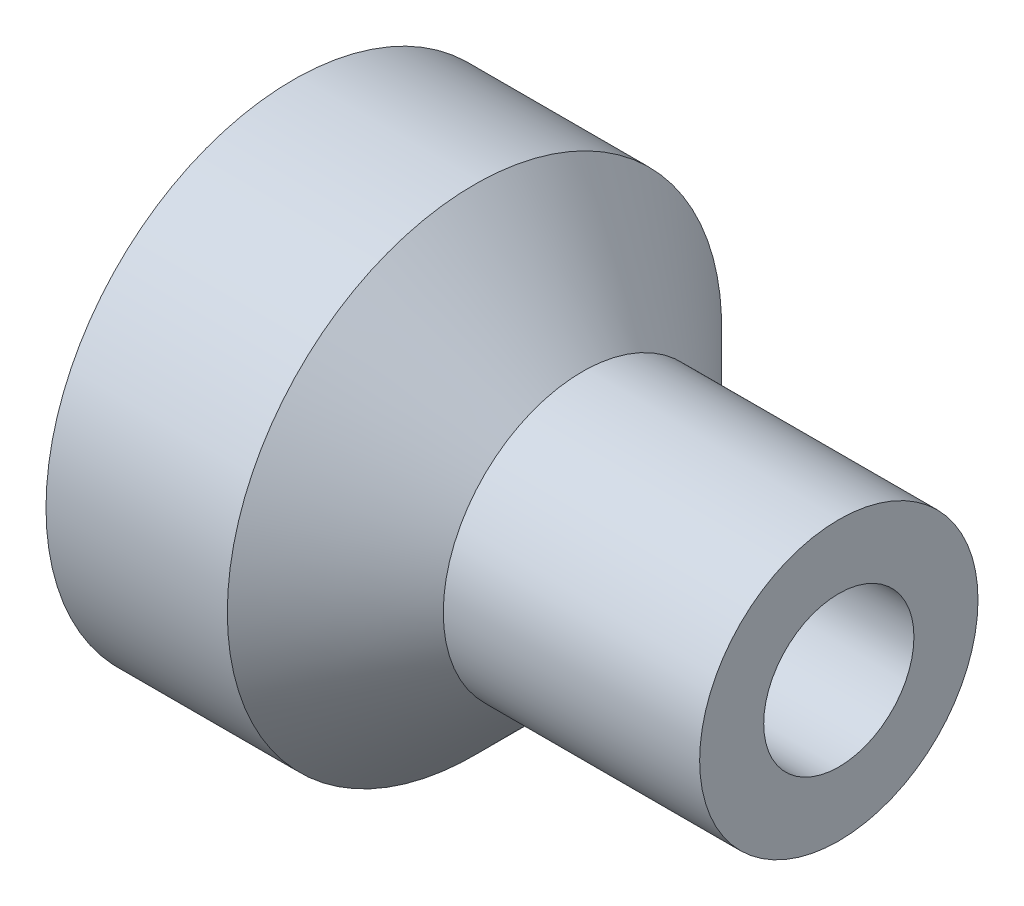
ISO-10303-21;
HEADER;
FILE_DESCRIPTION(('STEP AP214'),'2;1');
FILE_NAME('part.step','',(''),(''),'','','');
FILE_SCHEMA(('AUTOMOTIVE_DESIGN { 1 0 10303 214 1 1 1 1 }'));
ENDSEC;
DATA;
#1=APPLICATION_CONTEXT('core data for automotive mechanical design processes');
#2=APPLICATION_PROTOCOL_DEFINITION('international standard','automotive_design',2000,#1);
#3=PRODUCT_CONTEXT('',#1,'mechanical');
#4=PRODUCT('Part','Part','',(#3));
#5=PRODUCT_RELATED_PRODUCT_CATEGORY('part','',(#4));
#6=PRODUCT_DEFINITION_FORMATION('','',#4);
#7=PRODUCT_DEFINITION_CONTEXT('part definition',#1,'design');
#8=PRODUCT_DEFINITION('design','',#6,#7);
#9=PRODUCT_DEFINITION_SHAPE('','',#8);
#10=(LENGTH_UNIT() NAMED_UNIT(*) SI_UNIT(.MILLI.,.METRE.));
#11=(NAMED_UNIT(*) PLANE_ANGLE_UNIT() SI_UNIT($,.RADIAN.));
#12=(NAMED_UNIT(*) SI_UNIT($,.STERADIAN.) SOLID_ANGLE_UNIT());
#13=UNCERTAINTY_MEASURE_WITH_UNIT(LENGTH_MEASURE(1.E-05),#10,'distance_accuracy_value','');
#14=(GEOMETRIC_REPRESENTATION_CONTEXT(3) GLOBAL_UNCERTAINTY_ASSIGNED_CONTEXT((#13)) GLOBAL_UNIT_ASSIGNED_CONTEXT((#10,
#11,#12)) REPRESENTATION_CONTEXT('',''));
#15=CARTESIAN_POINT('',(0.,0.,0.));
#16=DIRECTION('',(0.,0.,1.));
#17=DIRECTION('',(1.,0.,0.));
#18=AXIS2_PLACEMENT_3D('',#15,#16,#17);
#19=CARTESIAN_POINT('',(15.8,0.,0.));
#20=DIRECTION('',(-1.,0.,0.));
#21=DIRECTION('',(0.,0.,1.));
#22=AXIS2_PLACEMENT_3D('',#19,#20,#21);
#23=CYLINDRICAL_SURFACE('',#22,2.175);
#24=CARTESIAN_POINT('',(9.00000000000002,0.,0.));
#25=DIRECTION('',(-1.,0.,0.));
#26=DIRECTION('',(0.,0.,1.));
#27=AXIS2_PLACEMENT_3D('',#24,#25,#26);
#28=CIRCLE('',#27,2.175);
#29=CARTESIAN_POINT('',(9.00000000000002,0.,2.175));
#30=VERTEX_POINT('',#29);
#31=EDGE_CURVE('E40',#30,#30,#28,.T.);
#32=ORIENTED_EDGE('',*,*,#31,.T.);
#33=EDGE_LOOP('',(#32));
#34=FACE_BOUND('',#33,.T.);
#35=CARTESIAN_POINT('',(15.8,0.,0.));
#36=DIRECTION('',(1.,0.,0.));
#37=DIRECTION('',(0.,0.,-1.));
#38=AXIS2_PLACEMENT_3D('',#35,#36,#37);
#39=CIRCLE('',#38,2.175);
#40=CARTESIAN_POINT('',(15.8,0.,-2.175));
#41=VERTEX_POINT('',#40);
#42=EDGE_CURVE('E56',#41,#41,#39,.T.);
#43=ORIENTED_EDGE('',*,*,#42,.T.);
#44=EDGE_LOOP('',(#43));
#45=FACE_BOUND('',#44,.T.);
#46=ADVANCED_FACE('F33',(#34,#45),#23,.F.);
#47=CARTESIAN_POINT('',(15.8,0.,0.));
#48=DIRECTION('',(-1.,0.,0.));
#49=DIRECTION('',(0.,0.,1.));
#50=AXIS2_PLACEMENT_3D('',#47,#48,#49);
#51=CYLINDRICAL_SURFACE('',#50,4.03);
#52=CARTESIAN_POINT('',(8.37669643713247,0.,0.));
#53=DIRECTION('',(-1.,0.,0.));
#54=DIRECTION('',(0.,0.,1.));
#55=AXIS2_PLACEMENT_3D('',#52,#53,#54);
#56=CIRCLE('',#55,4.03);
#57=CARTESIAN_POINT('',(8.37669643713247,0.,4.03));
#58=VERTEX_POINT('',#57);
#59=EDGE_CURVE('E44',#58,#58,#56,.F.);
#60=ORIENTED_EDGE('',*,*,#59,.T.);
#61=EDGE_LOOP('',(#60));
#62=FACE_BOUND('',#61,.T.);
#63=CARTESIAN_POINT('',(15.8,0.,0.));
#64=DIRECTION('',(1.,0.,0.));
#65=DIRECTION('',(0.,0.,-1.));
#66=AXIS2_PLACEMENT_3D('',#63,#64,#65);
#67=CIRCLE('',#66,4.03);
#68=CARTESIAN_POINT('',(15.8,0.,-4.03));
#69=VERTEX_POINT('',#68);
#70=EDGE_CURVE('E53',#69,#69,#67,.T.);
#71=ORIENTED_EDGE('',*,*,#70,.F.);
#72=EDGE_LOOP('',(#71));
#73=FACE_BOUND('',#72,.T.);
#74=ADVANCED_FACE('F87',(#62,#73),#51,.T.);
#75=CARTESIAN_POINT('',(15.8,0.,0.));
#76=DIRECTION('',(1.,0.,0.));
#77=DIRECTION('',(0.,0.,-1.));
#78=AXIS2_PLACEMENT_3D('',#75,#76,#77);
#79=PLANE('',#78);
#80=ORIENTED_EDGE('',*,*,#70,.T.);
#81=EDGE_LOOP('',(#80));
#82=FACE_BOUND('',#81,.T.);
#83=ORIENTED_EDGE('',*,*,#42,.F.);
#84=EDGE_LOOP('',(#83));
#85=FACE_BOUND('',#84,.T.);
#86=ADVANCED_FACE('F72',(#82,#85),#79,.T.);
#87=CARTESIAN_POINT('',(0.,0.,0.));
#88=DIRECTION('',(1.,0.,0.));
#89=DIRECTION('',(0.,0.,-1.));
#90=AXIS2_PLACEMENT_3D('',#87,#88,#89);
#91=PLANE('',#90);
#92=CARTESIAN_POINT('',(0.,0.,0.));
#93=DIRECTION('',(-1.,0.,0.));
#94=DIRECTION('',(0.,0.,1.));
#95=AXIS2_PLACEMENT_3D('',#92,#93,#94);
#96=CIRCLE('',#95,3.075);
#97=CARTESIAN_POINT('',(0.,0.,3.075));
#98=VERTEX_POINT('',#97);
#99=EDGE_CURVE('E62',#98,#98,#96,.T.);
#100=ORIENTED_EDGE('',*,*,#99,.F.);
#101=EDGE_LOOP('',(#100));
#102=FACE_BOUND('',#101,.T.);
#103=CARTESIAN_POINT('',(0.,0.,0.));
#104=DIRECTION('',(-1.,0.,0.));
#105=DIRECTION('',(0.,0.,1.));
#106=AXIS2_PLACEMENT_3D('',#103,#104,#105);
#107=CIRCLE('',#106,7.1566964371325);
#108=CARTESIAN_POINT('',(0.,0.,7.1566964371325));
#109=VERTEX_POINT('',#108);
#110=EDGE_CURVE('E59',#109,#109,#107,.T.);
#111=ORIENTED_EDGE('',*,*,#110,.T.);
#112=EDGE_LOOP('',(#111));
#113=FACE_BOUND('',#112,.T.);
#114=ADVANCED_FACE('F68',(#102,#113),#91,.F.);
#115=CARTESIAN_POINT('',(8.8,0.,0.));
#116=DIRECTION('',(-1.,0.,0.));
#117=DIRECTION('',(0.,0.,1.));
#118=AXIS2_PLACEMENT_3D('',#115,#116,#117);
#119=CYLINDRICAL_SURFACE('',#118,7.1566964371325);
#120=CARTESIAN_POINT('',(5.24999999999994,0.,0.));
#121=DIRECTION('',(-1.,0.,0.));
#122=DIRECTION('',(0.,0.,1.));
#123=AXIS2_PLACEMENT_3D('',#120,#121,#122);
#124=CIRCLE('',#123,7.1566964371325);
#125=CARTESIAN_POINT('',(5.24999999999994,0.,7.1566964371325));
#126=VERTEX_POINT('',#125);
#127=EDGE_CURVE('E48',#126,#126,#124,.T.);
#128=ORIENTED_EDGE('',*,*,#127,.T.);
#129=EDGE_LOOP('',(#128));
#130=FACE_BOUND('',#129,.T.);
#131=ORIENTED_EDGE('',*,*,#110,.F.);
#132=EDGE_LOOP('',(#131));
#133=FACE_BOUND('',#132,.T.);
#134=ADVANCED_FACE('F71',(#130,#133),#119,.T.);
#135=CARTESIAN_POINT('',(5.24999999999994,0.,0.));
#136=DIRECTION('',(-1.,0.,0.));
#137=DIRECTION('',(0.,0.,1.));
#138=AXIS2_PLACEMENT_3D('',#135,#136,#137);
#139=CONICAL_SURFACE('',#138,7.1566964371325,0.785398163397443);
#140=ORIENTED_EDGE('',*,*,#59,.F.);
#141=EDGE_LOOP('',(#140));
#142=FACE_BOUND('',#141,.T.);
#143=ORIENTED_EDGE('',*,*,#127,.F.);
#144=EDGE_LOOP('',(#143));
#145=FACE_BOUND('',#144,.T.);
#146=ADVANCED_FACE('F77',(#142,#145),#139,.T.);
#147=CARTESIAN_POINT('',(8.,0.,0.));
#148=DIRECTION('',(-1.,0.,0.));
#149=DIRECTION('',(0.,0.,1.));
#150=AXIS2_PLACEMENT_3D('',#147,#148,#149);
#151=CYLINDRICAL_SURFACE('',#150,3.075);
#152=CARTESIAN_POINT('',(8.10000000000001,0.,0.));
#153=DIRECTION('',(-1.,0.,0.));
#154=DIRECTION('',(0.,0.,1.));
#155=AXIS2_PLACEMENT_3D('',#152,#153,#154);
#156=CIRCLE('',#155,3.075);
#157=CARTESIAN_POINT('',(8.10000000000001,0.,3.075));
#158=VERTEX_POINT('',#157);
#159=EDGE_CURVE('E10',#158,#158,#156,.F.);
#160=ORIENTED_EDGE('',*,*,#159,.T.);
#161=EDGE_LOOP('',(#160));
#162=FACE_BOUND('',#161,.T.);
#163=ORIENTED_EDGE('',*,*,#99,.T.);
#164=EDGE_LOOP('',(#163));
#165=FACE_BOUND('',#164,.T.);
#166=ADVANCED_FACE('F66',(#162,#165),#151,.F.);
#167=CARTESIAN_POINT('',(9.00000000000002,0.,0.));
#168=DIRECTION('',(-1.,0.,0.));
#169=DIRECTION('',(0.,0.,1.));
#170=AXIS2_PLACEMENT_3D('',#167,#168,#169);
#171=CONICAL_SURFACE('',#170,2.175,0.785398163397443);
#172=ORIENTED_EDGE('',*,*,#159,.F.);
#173=EDGE_LOOP('',(#172));
#174=FACE_BOUND('',#173,.T.);
#175=ORIENTED_EDGE('',*,*,#31,.F.);
#176=EDGE_LOOP('',(#175));
#177=FACE_BOUND('',#176,.T.);
#178=ADVANCED_FACE('F35',(#174,#177),#171,.F.);
#179=CLOSED_SHELL('',(#46,#74,#86,#114,#134,#146,#166,#178));
#180=MANIFOLD_SOLID_BREP('B2',#179);
#181=ADVANCED_BREP_SHAPE_REPRESENTATION('',(#18,#180),#14);
#182=SHAPE_DEFINITION_REPRESENTATION(#9,#181);
ENDSEC;
END-ISO-10303-21;
